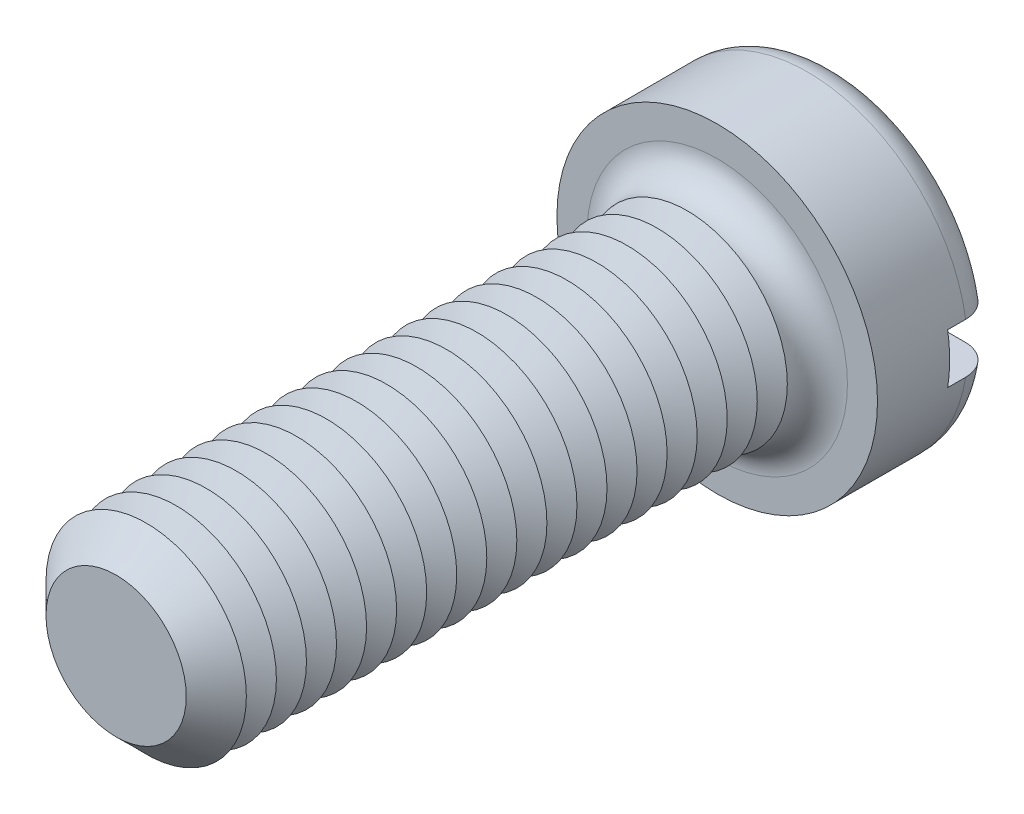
from build123d import *

# Parameters (mm, degrees)
SKETCH3_R           = 8
BOSS_EXTRUDE2_DEPTH = 6
SKETCH4_R           = 5
BOSS_EXTRUDE3_DEPTH = 30
FILLET1_R           = 1.5
CHAMFER1_SIZE       = 1.5
LPATTERN1_COUNT     = 18
LPATTERN1_PITCH     = 1.5
SKETCH8_W           = 16
SKETCH8_H           = 2.5
CUT_EXTRUDE1_DEPTH  = 2.4


with BuildPart() as part:
    # Sketch3 → Boss-Extrude2 (new body)
    with BuildSketch(Plane.XY):
        Circle(SKETCH3_R)
    extrude(amount=-BOSS_EXTRUDE2_DEPTH)

    # Sketch4 → Boss-Extrude3 (add)
    with BuildSketch(Plane.XY):
        Circle(SKETCH4_R)
    extrude(amount=BOSS_EXTRUDE3_DEPTH)

    # Fillet1
    fillet1_edges = [part.edges().sort_by_distance(p)[0] for p in [
        (-8, 0, -6),
        (-5, 0, 0),
    ]]
    fillet(fillet1_edges, radius=FILLET1_R)

    # Chamfer1
    chamfer1_edges = [part.edges().sort_by_distance(p)[0] for p in [
        (-5, 0, 30),
    ]]
    chamfer(chamfer1_edges, length=CHAMFER1_SIZE)

    # Sketch6 → Cut-Revolve1 (revolve, cut)
    with BuildSketch(Plane(origin=(0, 0, 0), x_dir=(0, 0, -1), z_dir=(1, 0, 0)), mode=Mode.PRIVATE) as cut_revolve1_sk:
        Polygon((-1.5, 5), (-2.25, 3.700961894), (-3, 5), align=None)
    cut_revolve1 = revolve(cut_revolve1_sk.sketch.rotate(Axis((0, 0, -1.694361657), (0, 0, 1)), 90), axis=Axis((0, 0, -1.694361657), (0, 0, 1)), mode=Mode.SUBTRACT)

    # LPattern1: Cut-Revolve1 ×18
    with Locations(*[(0, 0, i * LPATTERN1_PITCH) for i in range(1, LPATTERN1_COUNT)]):
        add(cut_revolve1, mode=Mode.SUBTRACT)

    # Sketch8 → Cut-Extrude1 (cut)
    with BuildSketch(Plane(origin=(0, 0, -6), x_dir=(-1, 0, 0), z_dir=(0, 0, -1))):
        Rectangle(SKETCH8_W, SKETCH8_H)
    extrude(amount=-CUT_EXTRUDE1_DEPTH, mode=Mode.SUBTRACT)


solid = part.part
